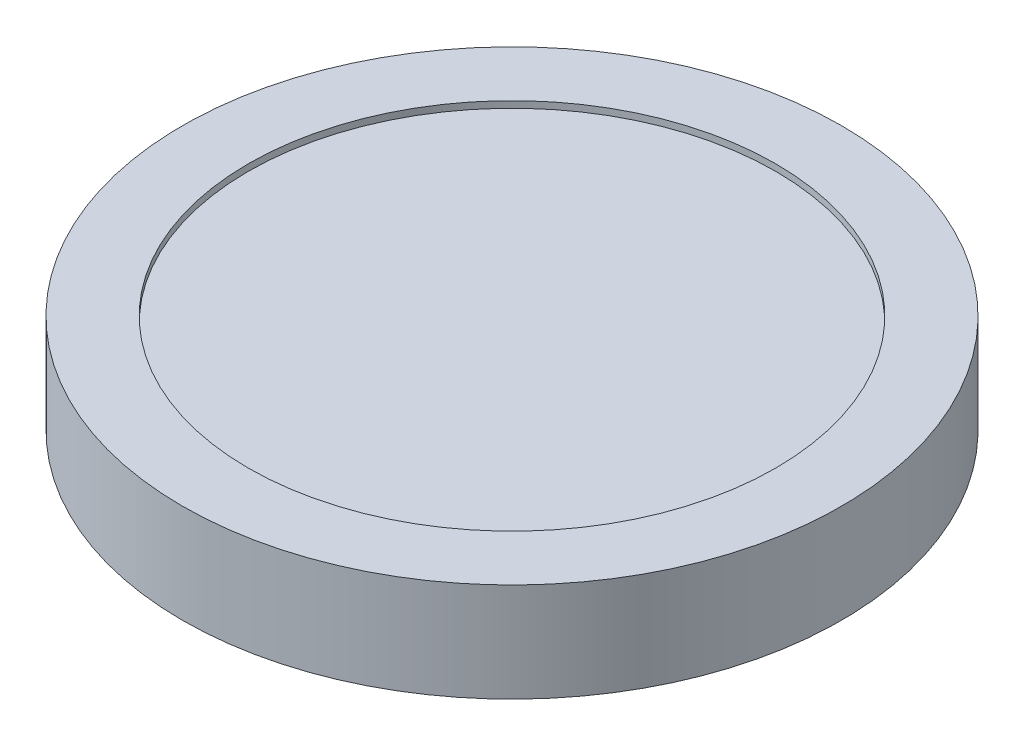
ISO-10303-21;
HEADER;
FILE_DESCRIPTION(('STEP AP214'),'2;1');
FILE_NAME('part.step','',(''),(''),'','','');
FILE_SCHEMA(('AUTOMOTIVE_DESIGN { 1 0 10303 214 1 1 1 1 }'));
ENDSEC;
DATA;
#1=APPLICATION_CONTEXT('core data for automotive mechanical design processes');
#2=APPLICATION_PROTOCOL_DEFINITION('international standard','automotive_design',2000,#1);
#3=PRODUCT_CONTEXT('',#1,'mechanical');
#4=PRODUCT('Part','Part','',(#3));
#5=PRODUCT_RELATED_PRODUCT_CATEGORY('part','',(#4));
#6=PRODUCT_DEFINITION_FORMATION('','',#4);
#7=PRODUCT_DEFINITION_CONTEXT('part definition',#1,'design');
#8=PRODUCT_DEFINITION('design','',#6,#7);
#9=PRODUCT_DEFINITION_SHAPE('','',#8);
#10=(LENGTH_UNIT() NAMED_UNIT(*) SI_UNIT(.MILLI.,.METRE.));
#11=(NAMED_UNIT(*) PLANE_ANGLE_UNIT() SI_UNIT($,.RADIAN.));
#12=(NAMED_UNIT(*) SI_UNIT($,.STERADIAN.) SOLID_ANGLE_UNIT());
#13=UNCERTAINTY_MEASURE_WITH_UNIT(LENGTH_MEASURE(1.E-05),#10,'distance_accuracy_value','');
#14=(GEOMETRIC_REPRESENTATION_CONTEXT(3) GLOBAL_UNCERTAINTY_ASSIGNED_CONTEXT((#13)) GLOBAL_UNIT_ASSIGNED_CONTEXT((#10,
#11,#12)) REPRESENTATION_CONTEXT('',''));
#15=CARTESIAN_POINT('',(0.,0.,0.));
#16=DIRECTION('',(0.,0.,1.));
#17=DIRECTION('',(1.,0.,0.));
#18=AXIS2_PLACEMENT_3D('',#15,#16,#17);
#19=CARTESIAN_POINT('',(0.,15.,0.));
#20=DIRECTION('',(0.,-1.,0.));
#21=DIRECTION('',(0.,0.,-1.));
#22=AXIS2_PLACEMENT_3D('',#19,#20,#21);
#23=CYLINDRICAL_SURFACE('',#22,50.);
#24=CARTESIAN_POINT('',(0.,15.,0.));
#25=DIRECTION('',(0.,1.,0.));
#26=DIRECTION('',(0.,0.,1.));
#27=AXIS2_PLACEMENT_3D('',#24,#25,#26);
#28=CIRCLE('',#27,50.);
#29=CARTESIAN_POINT('',(0.,15.,50.));
#30=VERTEX_POINT('',#29);
#31=EDGE_CURVE('E10',#30,#30,#28,.T.);
#32=ORIENTED_EDGE('',*,*,#31,.F.);
#33=EDGE_LOOP('',(#32));
#34=FACE_BOUND('',#33,.T.);
#35=CARTESIAN_POINT('',(0.,0.,0.));
#36=DIRECTION('',(0.,1.,0.));
#37=DIRECTION('',(0.,0.,1.));
#38=AXIS2_PLACEMENT_3D('',#35,#36,#37);
#39=CIRCLE('',#38,50.);
#40=CARTESIAN_POINT('',(0.,0.,50.));
#41=VERTEX_POINT('',#40);
#42=EDGE_CURVE('E39',#41,#41,#39,.T.);
#43=ORIENTED_EDGE('',*,*,#42,.T.);
#44=EDGE_LOOP('',(#43));
#45=FACE_BOUND('',#44,.T.);
#46=ADVANCED_FACE('F36',(#34,#45),#23,.T.);
#47=CARTESIAN_POINT('',(0.,15.,0.));
#48=DIRECTION('',(0.,1.,0.));
#49=DIRECTION('',(0.,0.,1.));
#50=AXIS2_PLACEMENT_3D('',#47,#48,#49);
#51=PLANE('',#50);
#52=CARTESIAN_POINT('',(0.,15.,0.));
#53=DIRECTION('',(0.,1.,0.));
#54=DIRECTION('',(0.,0.,1.));
#55=AXIS2_PLACEMENT_3D('',#52,#53,#54);
#56=CIRCLE('',#55,40.);
#57=CARTESIAN_POINT('',(0.,15.,40.));
#58=VERTEX_POINT('',#57);
#59=EDGE_CURVE('E50',#58,#58,#56,.T.);
#60=ORIENTED_EDGE('',*,*,#59,.F.);
#61=EDGE_LOOP('',(#60));
#62=FACE_BOUND('',#61,.T.);
#63=ORIENTED_EDGE('',*,*,#31,.T.);
#64=EDGE_LOOP('',(#63));
#65=FACE_BOUND('',#64,.T.);
#66=ADVANCED_FACE('F79',(#62,#65),#51,.T.);
#67=CARTESIAN_POINT('',(0.,0.,0.));
#68=DIRECTION('',(0.,1.,0.));
#69=DIRECTION('',(0.,0.,1.));
#70=AXIS2_PLACEMENT_3D('',#67,#68,#69);
#71=PLANE('',#70);
#72=CARTESIAN_POINT('',(0.,0.,0.));
#73=DIRECTION('',(0.,-1.,0.));
#74=DIRECTION('',(0.,0.,-1.));
#75=AXIS2_PLACEMENT_3D('',#72,#73,#74);
#76=CIRCLE('',#75,48.5);
#77=CARTESIAN_POINT('',(0.,0.,-48.5));
#78=VERTEX_POINT('',#77);
#79=EDGE_CURVE('E58',#78,#78,#76,.T.);
#80=ORIENTED_EDGE('',*,*,#79,.F.);
#81=EDGE_LOOP('',(#80));
#82=FACE_BOUND('',#81,.T.);
#83=ORIENTED_EDGE('',*,*,#42,.F.);
#84=EDGE_LOOP('',(#83));
#85=FACE_BOUND('',#84,.T.);
#86=ADVANCED_FACE('F75',(#82,#85),#71,.F.);
#87=CARTESIAN_POINT('',(0.,14.,0.));
#88=DIRECTION('',(0.,1.,0.));
#89=DIRECTION('',(0.,0.,1.));
#90=AXIS2_PLACEMENT_3D('',#87,#88,#89);
#91=CYLINDRICAL_SURFACE('',#90,40.);
#92=CARTESIAN_POINT('',(0.,14.,0.));
#93=DIRECTION('',(0.,1.,0.));
#94=DIRECTION('',(0.,0.,1.));
#95=AXIS2_PLACEMENT_3D('',#92,#93,#94);
#96=CIRCLE('',#95,40.);
#97=CARTESIAN_POINT('',(0.,14.,40.));
#98=VERTEX_POINT('',#97);
#99=EDGE_CURVE('E48',#98,#98,#96,.T.);
#100=ORIENTED_EDGE('',*,*,#99,.F.);
#101=EDGE_LOOP('',(#100));
#102=FACE_BOUND('',#101,.T.);
#103=ORIENTED_EDGE('',*,*,#59,.T.);
#104=EDGE_LOOP('',(#103));
#105=FACE_BOUND('',#104,.T.);
#106=ADVANCED_FACE('F78',(#102,#105),#91,.F.);
#107=CARTESIAN_POINT('',(0.,14.,0.));
#108=DIRECTION('',(0.,1.,0.));
#109=DIRECTION('',(0.,0.,1.));
#110=AXIS2_PLACEMENT_3D('',#107,#108,#109);
#111=PLANE('',#110);
#112=ORIENTED_EDGE('',*,*,#99,.T.);
#113=EDGE_LOOP('',(#112));
#114=FACE_BOUND('',#113,.T.);
#115=ADVANCED_FACE('F71',(#114),#111,.T.);
#116=CARTESIAN_POINT('',(0.,13.5,0.));
#117=DIRECTION('',(0.,-1.,0.));
#118=DIRECTION('',(0.,0.,-1.));
#119=AXIS2_PLACEMENT_3D('',#116,#117,#118);
#120=CYLINDRICAL_SURFACE('',#119,48.5);
#121=CARTESIAN_POINT('',(0.,13.5,0.));
#122=DIRECTION('',(0.,-1.,0.));
#123=DIRECTION('',(0.,0.,-1.));
#124=AXIS2_PLACEMENT_3D('',#121,#122,#123);
#125=CIRCLE('',#124,48.5);
#126=CARTESIAN_POINT('',(0.,13.5,-48.5));
#127=VERTEX_POINT('',#126);
#128=EDGE_CURVE('E54',#127,#127,#125,.T.);
#129=ORIENTED_EDGE('',*,*,#128,.F.);
#130=EDGE_LOOP('',(#129));
#131=FACE_BOUND('',#130,.T.);
#132=ORIENTED_EDGE('',*,*,#79,.T.);
#133=EDGE_LOOP('',(#132));
#134=FACE_BOUND('',#133,.T.);
#135=ADVANCED_FACE('F68',(#131,#134),#120,.F.);
#136=CARTESIAN_POINT('',(0.,13.5,0.));
#137=DIRECTION('',(0.,-1.,0.));
#138=DIRECTION('',(0.,0.,-1.));
#139=AXIS2_PLACEMENT_3D('',#136,#137,#138);
#140=PLANE('',#139);
#141=ORIENTED_EDGE('',*,*,#128,.T.);
#142=EDGE_LOOP('',(#141));
#143=FACE_BOUND('',#142,.T.);
#144=ADVANCED_FACE('F66',(#143),#140,.T.);
#145=CLOSED_SHELL('',(#46,#66,#86,#106,#115,#135,#144));
#146=MANIFOLD_SOLID_BREP('B2',#145);
#147=ADVANCED_BREP_SHAPE_REPRESENTATION('',(#18,#146),#14);
#148=SHAPE_DEFINITION_REPRESENTATION(#9,#147);
ENDSEC;
END-ISO-10303-21;
